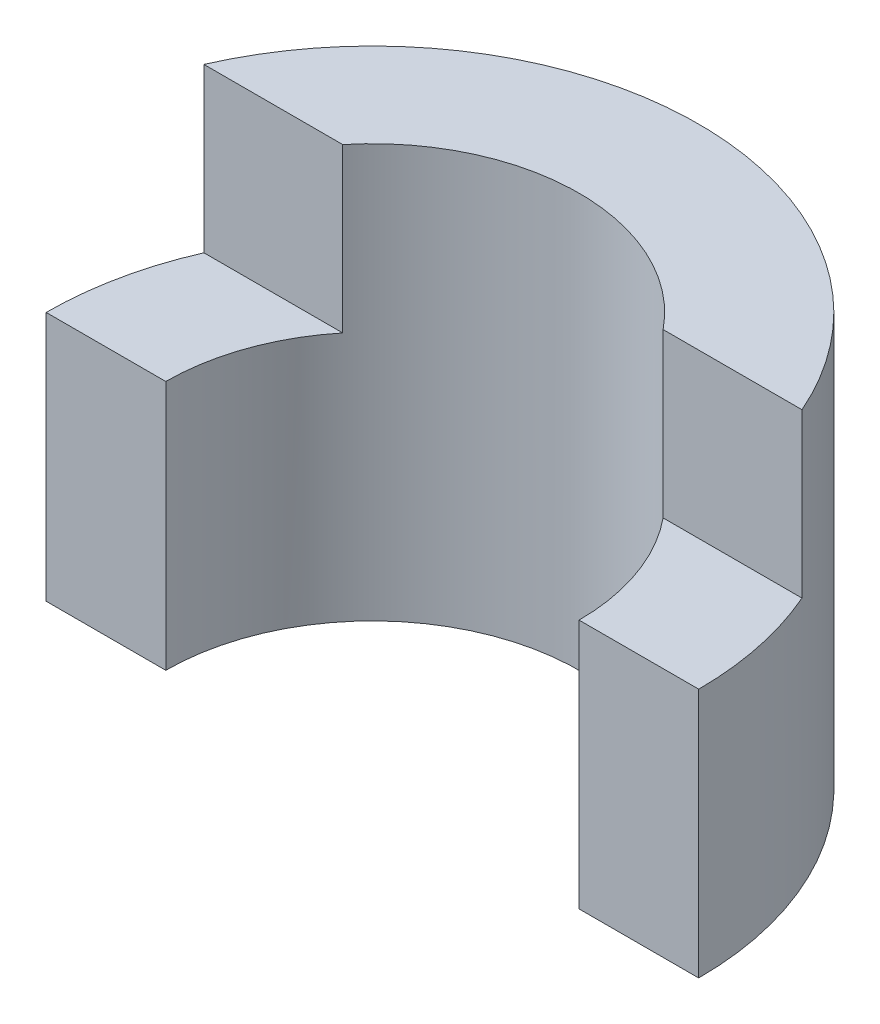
ISO-10303-21;
HEADER;
FILE_DESCRIPTION(('STEP AP214'),'2;1');
FILE_NAME('part.step','',(''),(''),'','','');
FILE_SCHEMA(('AUTOMOTIVE_DESIGN { 1 0 10303 214 1 1 1 1 }'));
ENDSEC;
DATA;
#1=APPLICATION_CONTEXT('core data for automotive mechanical design processes');
#2=APPLICATION_PROTOCOL_DEFINITION('international standard','automotive_design',2000,#1);
#3=PRODUCT_CONTEXT('',#1,'mechanical');
#4=PRODUCT('Part','Part','',(#3));
#5=PRODUCT_RELATED_PRODUCT_CATEGORY('part','',(#4));
#6=PRODUCT_DEFINITION_FORMATION('','',#4);
#7=PRODUCT_DEFINITION_CONTEXT('part definition',#1,'design');
#8=PRODUCT_DEFINITION('design','',#6,#7);
#9=PRODUCT_DEFINITION_SHAPE('','',#8);
#10=(LENGTH_UNIT() NAMED_UNIT(*) SI_UNIT(.MILLI.,.METRE.));
#11=(NAMED_UNIT(*) PLANE_ANGLE_UNIT() SI_UNIT($,.RADIAN.));
#12=(NAMED_UNIT(*) SI_UNIT($,.STERADIAN.) SOLID_ANGLE_UNIT());
#13=UNCERTAINTY_MEASURE_WITH_UNIT(LENGTH_MEASURE(1.E-05),#10,'distance_accuracy_value','');
#14=(GEOMETRIC_REPRESENTATION_CONTEXT(3) GLOBAL_UNCERTAINTY_ASSIGNED_CONTEXT((#13)) GLOBAL_UNIT_ASSIGNED_CONTEXT((#10,
#11,#12)) REPRESENTATION_CONTEXT('',''));
#15=CARTESIAN_POINT('',(0.,0.,0.));
#16=DIRECTION('',(0.,0.,1.));
#17=DIRECTION('',(1.,0.,0.));
#18=AXIS2_PLACEMENT_3D('',#15,#16,#17);
#19=CARTESIAN_POINT('',(30.,0.,0.));
#20=DIRECTION('',(0.,1.,0.));
#21=DIRECTION('',(0.,0.,1.));
#22=AXIS2_PLACEMENT_3D('',#19,#20,#21);
#23=PLANE('',#22);
#24=DIRECTION('',(1.,0.,0.));
#25=VECTOR('',#24,1.);
#26=CARTESIAN_POINT('',(30.,0.,0.));
#27=LINE('',#26,#25);
#28=CARTESIAN_POINT('',(-30.,0.,0.));
#29=VERTEX_POINT('',#28);
#30=CARTESIAN_POINT('',(-19.,0.,0.));
#31=VERTEX_POINT('',#30);
#32=EDGE_CURVE('E101',#29,#31,#27,.T.);
#33=ORIENTED_EDGE('',*,*,#32,.F.);
#34=CARTESIAN_POINT('',(0.,0.,0.));
#35=DIRECTION('',(0.,1.,0.));
#36=DIRECTION('',(0.,0.,1.));
#37=AXIS2_PLACEMENT_3D('',#34,#35,#36);
#38=CIRCLE('',#37,30.);
#39=CARTESIAN_POINT('',(30.,0.,0.));
#40=VERTEX_POINT('',#39);
#41=EDGE_CURVE('E100',#40,#29,#38,.T.);
#42=ORIENTED_EDGE('',*,*,#41,.F.);
#43=CARTESIAN_POINT('',(19.,0.,0.));
#44=VERTEX_POINT('',#43);
#45=EDGE_CURVE('E159',#44,#40,#27,.T.);
#46=ORIENTED_EDGE('',*,*,#45,.F.);
#47=CARTESIAN_POINT('',(0.,0.,0.));
#48=DIRECTION('',(0.,1.,0.));
#49=DIRECTION('',(0.,0.,1.));
#50=AXIS2_PLACEMENT_3D('',#47,#48,#49);
#51=CIRCLE('',#50,19.);
#52=EDGE_CURVE('E123',#44,#31,#51,.T.);
#53=ORIENTED_EDGE('',*,*,#52,.T.);
#54=EDGE_LOOP('',(#33,#42,#46,#53));
#55=FACE_BOUND('',#54,.T.);
#56=ADVANCED_FACE('F26',(#55),#23,.F.);
#57=CARTESIAN_POINT('',(0.,46.1769874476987,0.));
#58=DIRECTION('',(0.,1.,0.));
#59=DIRECTION('',(0.,0.,1.));
#60=AXIS2_PLACEMENT_3D('',#57,#58,#59);
#61=CYLINDRICAL_SURFACE('',#60,30.);
#62=DIRECTION('',(0.,1.,0.));
#63=VECTOR('',#62,1.);
#64=CARTESIAN_POINT('',(30.,46.1769874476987,0.));
#65=LINE('',#64,#63);
#66=CARTESIAN_POINT('',(30.,23.,0.));
#67=VERTEX_POINT('',#66);
#68=EDGE_CURVE('E40',#40,#67,#65,.T.);
#69=ORIENTED_EDGE('',*,*,#68,.F.);
#70=ORIENTED_EDGE('',*,*,#41,.T.);
#71=DIRECTION('',(0.,1.,0.));
#72=VECTOR('',#71,1.);
#73=CARTESIAN_POINT('',(-30.,46.1769874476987,0.));
#74=LINE('',#73,#72);
#75=CARTESIAN_POINT('',(-30.,23.,0.));
#76=VERTEX_POINT('',#75);
#77=EDGE_CURVE('E88',#76,#29,#74,.F.);
#78=ORIENTED_EDGE('',*,*,#77,.F.);
#79=CARTESIAN_POINT('',(0.,23.,0.));
#80=DIRECTION('',(0.,-1.,0.));
#81=DIRECTION('',(0.,0.,-1.));
#82=AXIS2_PLACEMENT_3D('',#79,#80,#81);
#83=CIRCLE('',#82,30.);
#84=CARTESIAN_POINT('',(-27.495454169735,23.,-12.));
#85=VERTEX_POINT('',#84);
#86=EDGE_CURVE('E97',#76,#85,#83,.T.);
#87=ORIENTED_EDGE('',*,*,#86,.T.);
#88=DIRECTION('',(0.,1.,0.));
#89=VECTOR('',#88,1.);
#90=CARTESIAN_POINT('',(-27.495454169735,46.1769874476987,-12.));
#91=LINE('',#90,#89);
#92=CARTESIAN_POINT('',(-27.495454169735,38.,-12.));
#93=VERTEX_POINT('',#92);
#94=EDGE_CURVE('E121',#85,#93,#91,.T.);
#95=ORIENTED_EDGE('',*,*,#94,.T.);
#96=CARTESIAN_POINT('',(0.,38.,0.));
#97=DIRECTION('',(0.,1.,0.));
#98=DIRECTION('',(0.,0.,1.));
#99=AXIS2_PLACEMENT_3D('',#96,#97,#98);
#100=CIRCLE('',#99,30.);
#101=CARTESIAN_POINT('',(27.495454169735,38.,-12.));
#102=VERTEX_POINT('',#101);
#103=EDGE_CURVE('E129',#102,#93,#100,.T.);
#104=ORIENTED_EDGE('',*,*,#103,.F.);
#105=DIRECTION('',(0.,1.,0.));
#106=VECTOR('',#105,1.);
#107=CARTESIAN_POINT('',(27.495454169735,46.1769874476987,-12.));
#108=LINE('',#107,#106);
#109=CARTESIAN_POINT('',(27.495454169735,23.,-12.));
#110=VERTEX_POINT('',#109);
#111=EDGE_CURVE('E117',#102,#110,#108,.F.);
#112=ORIENTED_EDGE('',*,*,#111,.T.);
#113=EDGE_CURVE('E107',#110,#67,#83,.T.);
#114=ORIENTED_EDGE('',*,*,#113,.T.);
#115=EDGE_LOOP('',(#69,#70,#78,#87,#95,#104,#112,#114));
#116=FACE_BOUND('',#115,.T.);
#117=ADVANCED_FACE('F95',(#116),#61,.T.);
#118=CARTESIAN_POINT('',(0.,46.1769874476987,0.));
#119=DIRECTION('',(0.,1.,0.));
#120=DIRECTION('',(0.,0.,1.));
#121=AXIS2_PLACEMENT_3D('',#118,#119,#120);
#122=CYLINDRICAL_SURFACE('',#121,19.);
#123=DIRECTION('',(0.,1.,0.));
#124=VECTOR('',#123,1.);
#125=CARTESIAN_POINT('',(19.,46.1769874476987,0.));
#126=LINE('',#125,#124);
#127=CARTESIAN_POINT('',(19.,23.,0.));
#128=VERTEX_POINT('',#127);
#129=EDGE_CURVE('E156',#128,#44,#126,.F.);
#130=ORIENTED_EDGE('',*,*,#129,.F.);
#131=CARTESIAN_POINT('',(0.,23.,0.));
#132=DIRECTION('',(0.,-1.,0.));
#133=DIRECTION('',(0.,0.,-1.));
#134=AXIS2_PLACEMENT_3D('',#131,#132,#133);
#135=CIRCLE('',#134,19.);
#136=CARTESIAN_POINT('',(14.7309198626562,23.,-12.));
#137=VERTEX_POINT('',#136);
#138=EDGE_CURVE('E133',#128,#137,#135,.F.);
#139=ORIENTED_EDGE('',*,*,#138,.T.);
#140=DIRECTION('',(0.,1.,0.));
#141=VECTOR('',#140,1.);
#142=CARTESIAN_POINT('',(14.7309198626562,46.1769874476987,-12.));
#143=LINE('',#142,#141);
#144=CARTESIAN_POINT('',(14.7309198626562,38.,-12.));
#145=VERTEX_POINT('',#144);
#146=EDGE_CURVE('E135',#137,#145,#143,.T.);
#147=ORIENTED_EDGE('',*,*,#146,.T.);
#148=CARTESIAN_POINT('',(0.,38.,0.));
#149=DIRECTION('',(0.,1.,0.));
#150=DIRECTION('',(0.,0.,1.));
#151=AXIS2_PLACEMENT_3D('',#148,#149,#150);
#152=CIRCLE('',#151,19.);
#153=CARTESIAN_POINT('',(-14.7309198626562,38.,-12.));
#154=VERTEX_POINT('',#153);
#155=EDGE_CURVE('E126',#145,#154,#152,.T.);
#156=ORIENTED_EDGE('',*,*,#155,.T.);
#157=DIRECTION('',(0.,1.,0.));
#158=VECTOR('',#157,1.);
#159=CARTESIAN_POINT('',(-14.7309198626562,46.1769874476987,-12.));
#160=LINE('',#159,#158);
#161=CARTESIAN_POINT('',(-14.7309198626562,23.,-12.));
#162=VERTEX_POINT('',#161);
#163=EDGE_CURVE('E33',#154,#162,#160,.F.);
#164=ORIENTED_EDGE('',*,*,#163,.T.);
#165=CARTESIAN_POINT('',(-19.,23.,0.));
#166=VERTEX_POINT('',#165);
#167=EDGE_CURVE('E136',#162,#166,#135,.F.);
#168=ORIENTED_EDGE('',*,*,#167,.T.);
#169=DIRECTION('',(0.,1.,0.));
#170=VECTOR('',#169,1.);
#171=CARTESIAN_POINT('',(-19.,46.1769874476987,0.));
#172=LINE('',#171,#170);
#173=EDGE_CURVE('E47',#31,#166,#172,.T.);
#174=ORIENTED_EDGE('',*,*,#173,.F.);
#175=ORIENTED_EDGE('',*,*,#52,.F.);
#176=EDGE_LOOP('',(#130,#139,#147,#156,#164,#168,#174,#175));
#177=FACE_BOUND('',#176,.T.);
#178=ADVANCED_FACE('F141',(#177),#122,.F.);
#179=CARTESIAN_POINT('',(-40.,23.,12.));
#180=DIRECTION('',(0.,-1.,0.));
#181=DIRECTION('',(0.,0.,-1.));
#182=AXIS2_PLACEMENT_3D('',#179,#180,#181);
#183=PLANE('',#182);
#184=DIRECTION('',(-1.,0.,0.));
#185=VECTOR('',#184,1.);
#186=CARTESIAN_POINT('',(-40.,23.,0.));
#187=LINE('',#186,#185);
#188=EDGE_CURVE('E163',#67,#128,#187,.T.);
#189=ORIENTED_EDGE('',*,*,#188,.F.);
#190=ORIENTED_EDGE('',*,*,#113,.F.);
#191=DIRECTION('',(1.,0.,0.));
#192=VECTOR('',#191,1.);
#193=CARTESIAN_POINT('',(-40.,23.,-12.));
#194=LINE('',#193,#192);
#195=EDGE_CURVE('E111',#137,#110,#194,.T.);
#196=ORIENTED_EDGE('',*,*,#195,.F.);
#197=ORIENTED_EDGE('',*,*,#138,.F.);
#198=EDGE_LOOP('',(#189,#190,#196,#197));
#199=FACE_BOUND('',#198,.T.);
#200=ADVANCED_FACE('F158',(#199),#183,.F.);
#201=DIRECTION('',(-1.,0.,0.));
#202=VECTOR('',#201,1.);
#203=CARTESIAN_POINT('',(-40.,23.,0.));
#204=LINE('',#203,#202);
#205=EDGE_CURVE('E11',#166,#76,#204,.T.);
#206=ORIENTED_EDGE('',*,*,#205,.F.);
#207=ORIENTED_EDGE('',*,*,#167,.F.);
#208=EDGE_CURVE('E106',#85,#162,#194,.T.);
#209=ORIENTED_EDGE('',*,*,#208,.F.);
#210=ORIENTED_EDGE('',*,*,#86,.F.);
#211=EDGE_LOOP('',(#206,#207,#209,#210));
#212=FACE_BOUND('',#211,.T.);
#213=ADVANCED_FACE('F104',(#212),#183,.F.);
#214=CARTESIAN_POINT('',(19.,38.,0.));
#215=DIRECTION('',(0.,-1.,0.));
#216=DIRECTION('',(0.,0.,-1.));
#217=AXIS2_PLACEMENT_3D('',#214,#215,#216);
#218=PLANE('',#217);
#219=ORIENTED_EDGE('',*,*,#103,.T.);
#220=DIRECTION('',(1.,0.,0.));
#221=VECTOR('',#220,1.);
#222=CARTESIAN_POINT('',(19.,38.,-12.));
#223=LINE('',#222,#221);
#224=EDGE_CURVE('E118',#93,#154,#223,.T.);
#225=ORIENTED_EDGE('',*,*,#224,.T.);
#226=ORIENTED_EDGE('',*,*,#155,.F.);
#227=EDGE_CURVE('E110',#145,#102,#223,.T.);
#228=ORIENTED_EDGE('',*,*,#227,.T.);
#229=EDGE_LOOP('',(#219,#225,#226,#228));
#230=FACE_BOUND('',#229,.T.);
#231=ADVANCED_FACE('F148',(#230),#218,.F.);
#232=CARTESIAN_POINT('',(-40.,38.5276615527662,-12.));
#233=DIRECTION('',(0.,0.,-1.));
#234=DIRECTION('',(0.,1.,0.));
#235=AXIS2_PLACEMENT_3D('',#232,#233,#234);
#236=PLANE('',#235);
#237=ORIENTED_EDGE('',*,*,#227,.F.);
#238=ORIENTED_EDGE('',*,*,#146,.F.);
#239=ORIENTED_EDGE('',*,*,#195,.T.);
#240=ORIENTED_EDGE('',*,*,#111,.F.);
#241=EDGE_LOOP('',(#237,#238,#239,#240));
#242=FACE_BOUND('',#241,.T.);
#243=ADVANCED_FACE('F152',(#242),#236,.F.);
#244=ORIENTED_EDGE('',*,*,#208,.T.);
#245=ORIENTED_EDGE('',*,*,#163,.F.);
#246=ORIENTED_EDGE('',*,*,#224,.F.);
#247=ORIENTED_EDGE('',*,*,#94,.F.);
#248=EDGE_LOOP('',(#244,#245,#246,#247));
#249=FACE_BOUND('',#248,.T.);
#250=ADVANCED_FACE('F144',(#249),#236,.F.);
#251=CARTESIAN_POINT('',(-32.4965132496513,-1.7810320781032,0.));
#252=DIRECTION('',(0.,0.,1.));
#253=DIRECTION('',(1.,0.,0.));
#254=AXIS2_PLACEMENT_3D('',#251,#252,#253);
#255=PLANE('',#254);
#256=ORIENTED_EDGE('',*,*,#32,.T.);
#257=ORIENTED_EDGE('',*,*,#173,.T.);
#258=ORIENTED_EDGE('',*,*,#205,.T.);
#259=ORIENTED_EDGE('',*,*,#77,.T.);
#260=EDGE_LOOP('',(#256,#257,#258,#259));
#261=FACE_BOUND('',#260,.T.);
#262=ADVANCED_FACE('F87',(#261),#255,.T.);
#263=ORIENTED_EDGE('',*,*,#45,.T.);
#264=ORIENTED_EDGE('',*,*,#68,.T.);
#265=ORIENTED_EDGE('',*,*,#188,.T.);
#266=ORIENTED_EDGE('',*,*,#129,.T.);
#267=EDGE_LOOP('',(#263,#264,#265,#266));
#268=FACE_BOUND('',#267,.T.);
#269=ADVANCED_FACE('F165',(#268),#255,.T.);
#270=CLOSED_SHELL('',(#56,#117,#178,#200,#213,#231,#243,#250,#262,#269));
#271=MANIFOLD_SOLID_BREP('B2',#270);
#272=ADVANCED_BREP_SHAPE_REPRESENTATION('',(#18,#271),#14);
#273=SHAPE_DEFINITION_REPRESENTATION(#9,#272);
ENDSEC;
END-ISO-10303-21;
